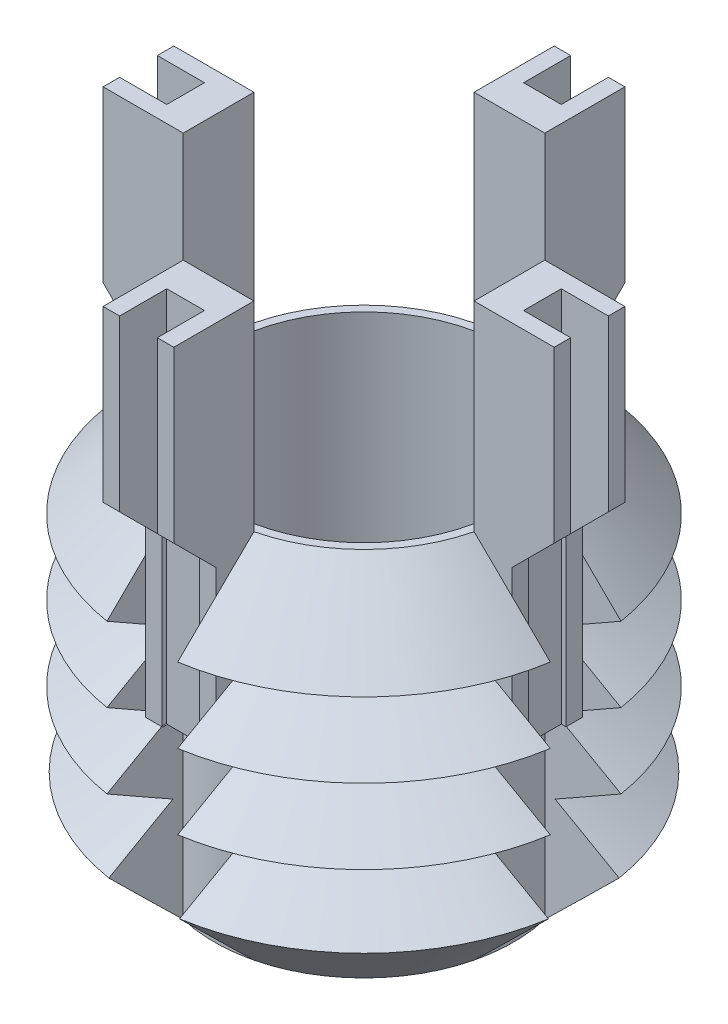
from build123d import *

# Parameters (mm, degrees)
SKETCH1_R           = 4.7625
BOSS_EXTRUDE1_DEPTH = 7.874
CHAMFER1_SIZE       = 1.587
LPATTERN1_COUNT     = 3
LPATTERN1_PITCH     = 1.587
CUT_EXTRUDE1_REACH  = 12.362
CIRPATTERN1_COUNT   = 4
BOSS_EXTRUDE3_DEPTH = 0.75
CIRPATTERN2_COUNT   = 4
CUT_EXTRUDE3_REACH  = 15.876
SKETCH6_W           = 1
SKETCH6_H           = 0.8
SKETCH6_W_2         = 0.8
SKETCH6_H_2         = 1
SKETCH7_R           = 3
CUT_EXTRUDE4_DEPTH  = 7.874


with BuildPart() as part:
    # Sketch1 → Boss-Extrude1 (new body)
    with BuildSketch(Plane(origin=(0, 0, 0), x_dir=(1, 0, 0), z_dir=(0, 1, 0))):
        with Locations(Location((0, 0, 0), (0, 0, 270))):
            Circle(SKETCH1_R)
    extrude(amount=-BOSS_EXTRUDE1_DEPTH)

    # Chamfer1
    chamfer1_edges = [part.edges().sort_by_distance(p)[0] for p in [
        (0, 0, -4.7625),
        (0, -7.874, -4.7625),
    ]]
    chamfer(chamfer1_edges, length=CHAMFER1_SIZE)

    # Sketch3 → Cut-Revolve1 (revolve, cut)
    with BuildSketch(Plane(origin=(0, 0, 0), x_dir=(0, 0, -1), z_dir=(1, 0, 0))):
        Polygon((-4.7625, -1.587), (-3.388117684, -2.3805), (-4.7625, -3.174), align=None)
    cut_revolve1 = revolve(axis=Axis((0, 0.885892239, 0), (0, -1, 0)), mode=Mode.SUBTRACT)

    # LPattern1: Cut-Revolve1 ×3
    with Locations(*[(0, -i * LPATTERN1_PITCH, 0) for i in range(1, LPATTERN1_COUNT)]):
        add(cut_revolve1, mode=Mode.SUBTRACT)

    # Cut-Extrude1: up to this cone (the profile starts inside it)
    cut_extrude1_end = Plane(origin=(0, 0, 0), z_dir=(0, 1, 0)).offset(-11.049499) * Cone(1e-06, 34.961, 34.960999, align=(Align.CENTER, Align.CENTER, Align.MIN), mode=Mode.PRIVATE)
    # Sketch4 → Cut-Extrude1 (cut, up to the surface)
    with BuildSketch(Plane(origin=(0, 0, 0), x_dir=(1, 0, 0), z_dir=(0, 1, 0)), mode=Mode.PRIVATE) as cut_extrude1_sk1:
        with BuildLine():
            Line((-3.085660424, 0.75), (-4.703074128, 0.75))
            ThreePointArc((-4.703074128, 0.75), (-4.7625, 0), (-4.703074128, -0.75))
            Line((-4.703074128, -0.75), (-3.085660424, -0.75))
            ThreePointArc((-3.085660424, -0.75), (-3.1755, 0), (-3.085660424, 0.75))
        make_face()
    cut_extrude1_tool1 = extrude(cut_extrude1_sk1.sketch, amount=-CUT_EXTRUDE1_REACH, mode=Mode.PRIVATE) & cut_extrude1_end
    cut_extrude1 = cut_extrude1_tool1.solids().sort_by_distance((-3.944107, 0, 0))[0]
    add(cut_extrude1, mode=Mode.SUBTRACT)

    # CirPattern1: Cut-Extrude1 ×4 about axis
    cirpattern1_axis = Axis((0, 0, 0), (0, 1, 0))
    for i in range(1, CIRPATTERN1_COUNT):
        add(cut_extrude1.rotate(cirpattern1_axis, i * 360 / CIRPATTERN1_COUNT), mode=Mode.SUBTRACT)

    # Sketch5 → Boss-Extrude3 (add, symmetric)
    with BuildSketch(Plane(origin=(0, 0, 0), x_dir=(0, 0, -1), z_dir=(1, 0, 0))):
        Polygon((-3.085660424, 4.239), (-3.085660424, -3.761), (-3.885660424, -3.761), (-3.885660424, -0.261), (-4.785660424, 0.639), (-4.785660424, 4.239), align=None)
    boss_extrude3 = extrude(amount=BOSS_EXTRUDE3_DEPTH, both=True)

    # CirPattern2: Boss-Extrude3 ×4 about axis
    cirpattern2_axis = Axis((0, 0, 0), (0, 1, 0))
    for i in range(1, CIRPATTERN2_COUNT):
        add(boss_extrude3.rotate(cirpattern2_axis, i * 360 / CIRPATTERN2_COUNT))

    # Cut-Extrude3: up to this plane
    cut_extrude3_end = Plane(origin=(-3.885660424, -0.261, 0.75), z_dir=(0.7071067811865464, 0.7071067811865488, -7.406550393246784e-15))
    # Sketch6 → Cut-Extrude3 (cut, up to the surface)
    with BuildSketch(Plane(origin=(0, 4.239, 0), x_dir=(1, 0, 0), z_dir=(0, 1, 0)), mode=Mode.PRIVATE) as cut_extrude3_sk1:
        with Locations((-4.285660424, 0)):
            Rectangle(SKETCH6_W, SKETCH6_H)
    cut_extrude3_tool1 = split(extrude(cut_extrude3_sk1.sketch, amount=-CUT_EXTRUDE3_REACH, mode=Mode.PRIVATE), bisect_by=cut_extrude3_end, keep=Keep.BOTH, mode=Mode.PRIVATE)
    add(cut_extrude3_tool1.solids().sort_by_distance((-4.28566, 4.239, 0))[0], mode=Mode.SUBTRACT)
    # Sketch6 → Cut-Extrude3 (cut, up to the surface)
    with BuildSketch(Plane(origin=(0, 4.239, 0), x_dir=(1, 0, 0), z_dir=(0, 1, 0)), mode=Mode.PRIVATE) as cut_extrude3_sk2:
        with Locations((0, 4.285660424)):
            Rectangle(SKETCH6_W_2, SKETCH6_H_2)
    cut_extrude3_tool2 = split(extrude(cut_extrude3_sk2.sketch, amount=-CUT_EXTRUDE3_REACH, mode=Mode.PRIVATE), bisect_by=cut_extrude3_end, keep=Keep.BOTH, mode=Mode.PRIVATE)
    add(cut_extrude3_tool2.solids().sort_by_distance((0, 4.239, -4.28566))[0], mode=Mode.SUBTRACT)
    # Sketch6 → Cut-Extrude3 (cut, up to the surface)
    with BuildSketch(Plane(origin=(0, 4.239, 0), x_dir=(1, 0, 0), z_dir=(0, 1, 0)), mode=Mode.PRIVATE) as cut_extrude3_sk3:
        with Locations((4.285660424, 0)):
            Rectangle(SKETCH6_W, SKETCH6_H)
    cut_extrude3_tool3 = split(extrude(cut_extrude3_sk3.sketch, amount=-CUT_EXTRUDE3_REACH, mode=Mode.PRIVATE), bisect_by=cut_extrude3_end, keep=Keep.BOTH, mode=Mode.PRIVATE)
    add(cut_extrude3_tool3.solids().sort_by_distance((4.28566, 4.239, 0))[0], mode=Mode.SUBTRACT)
    # Sketch6 → Cut-Extrude3 (cut, up to the surface)
    with BuildSketch(Plane(origin=(0, 4.239, 0), x_dir=(1, 0, 0), z_dir=(0, 1, 0)), mode=Mode.PRIVATE) as cut_extrude3_sk4:
        with Locations((0, -4.285660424)):
            Rectangle(SKETCH6_W_2, SKETCH6_H_2)
    cut_extrude3_tool4 = split(extrude(cut_extrude3_sk4.sketch, amount=-CUT_EXTRUDE3_REACH, mode=Mode.PRIVATE), bisect_by=cut_extrude3_end, keep=Keep.BOTH, mode=Mode.PRIVATE)
    add(cut_extrude3_tool4.solids().sort_by_distance((0, 4.239, 4.28566))[0], mode=Mode.SUBTRACT)

    # Sketch7 → Cut-Extrude4 (cut)
    with BuildSketch(Plane(origin=(0, 0, 0), x_dir=(1, 0, 0), z_dir=(0, 1, 0))):
        with Locations(Location((0, 0, 0), (0, 0, 270))):
            Circle(SKETCH7_R)
    extrude(amount=-CUT_EXTRUDE4_DEPTH, mode=Mode.SUBTRACT)


solid = part.part
